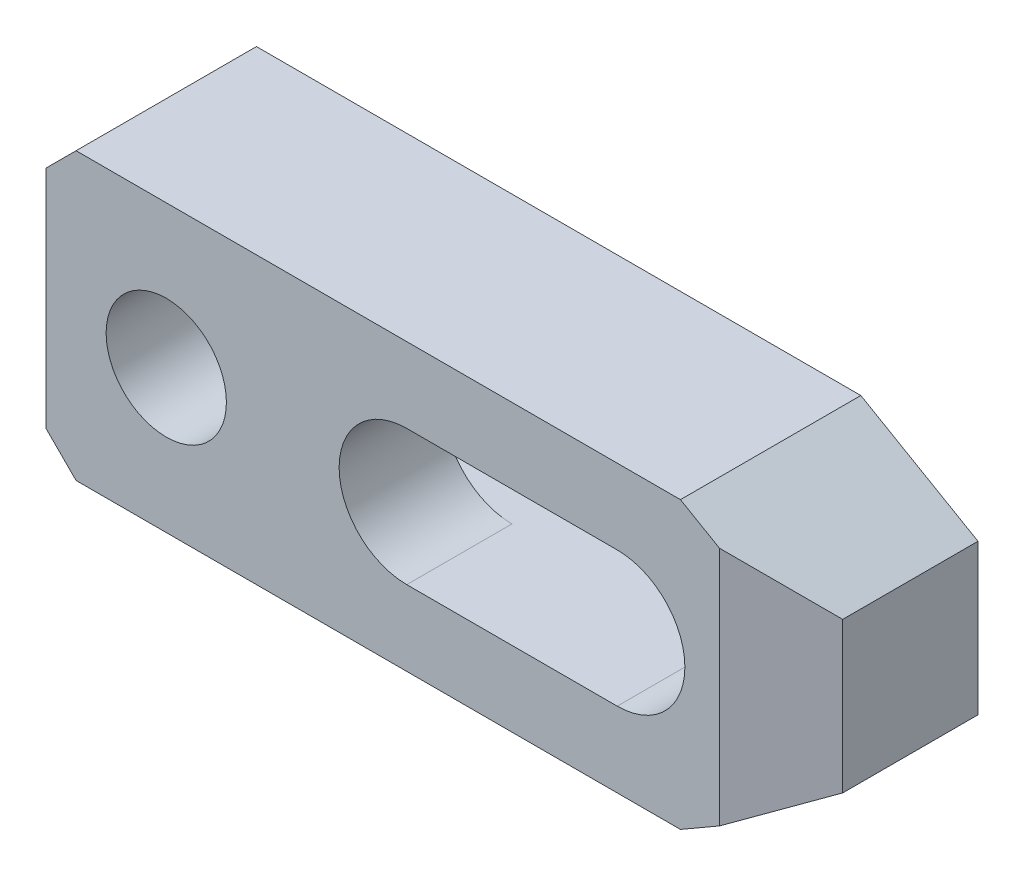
ISO-10303-21;
HEADER;
FILE_DESCRIPTION(('STEP AP214'),'2;1');
FILE_NAME('part.step','',(''),(''),'','','');
FILE_SCHEMA(('AUTOMOTIVE_DESIGN { 1 0 10303 214 1 1 1 1 }'));
ENDSEC;
DATA;
#1=APPLICATION_CONTEXT('core data for automotive mechanical design processes');
#2=APPLICATION_PROTOCOL_DEFINITION('international standard','automotive_design',2000,#1);
#3=PRODUCT_CONTEXT('',#1,'mechanical');
#4=PRODUCT('Part','Part','',(#3));
#5=PRODUCT_RELATED_PRODUCT_CATEGORY('part','',(#4));
#6=PRODUCT_DEFINITION_FORMATION('','',#4);
#7=PRODUCT_DEFINITION_CONTEXT('part definition',#1,'design');
#8=PRODUCT_DEFINITION('design','',#6,#7);
#9=PRODUCT_DEFINITION_SHAPE('','',#8);
#10=(LENGTH_UNIT() NAMED_UNIT(*) SI_UNIT(.MILLI.,.METRE.));
#11=(NAMED_UNIT(*) PLANE_ANGLE_UNIT() SI_UNIT($,.RADIAN.));
#12=(NAMED_UNIT(*) SI_UNIT($,.STERADIAN.) SOLID_ANGLE_UNIT());
#13=UNCERTAINTY_MEASURE_WITH_UNIT(LENGTH_MEASURE(1.E-05),#10,'distance_accuracy_value','');
#14=(GEOMETRIC_REPRESENTATION_CONTEXT(3) GLOBAL_UNCERTAINTY_ASSIGNED_CONTEXT((#13)) GLOBAL_UNIT_ASSIGNED_CONTEXT((#10,
#11,#12)) REPRESENTATION_CONTEXT('',''));
#15=CARTESIAN_POINT('',(0.,0.,0.));
#16=DIRECTION('',(0.,0.,1.));
#17=DIRECTION('',(1.,0.,0.));
#18=AXIS2_PLACEMENT_3D('',#15,#16,#17);
#19=CARTESIAN_POINT('',(-21.2836663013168,24.2163336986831,0.));
#20=DIRECTION('',(0.,0.,1.));
#21=DIRECTION('',(-1.,0.,0.));
#22=AXIS2_PLACEMENT_3D('',#19,#20,#21);
#23=PLANE('',#22);
#24=DIRECTION('',(0.,1.,0.));
#25=VECTOR('',#24,1.);
#26=CARTESIAN_POINT('',(-38.,-7.5,0.));
#27=LINE('',#26,#25);
#28=CARTESIAN_POINT('',(-38.,-7.5,0.));
#29=VERTEX_POINT('',#28);
#30=CARTESIAN_POINT('',(-38.,-4.5,0.));
#31=VERTEX_POINT('',#30);
#32=EDGE_CURVE('E147',#29,#31,#27,.T.);
#33=ORIENTED_EDGE('',*,*,#32,.T.);
#34=DIRECTION('',(-1.,0.,0.));
#35=VECTOR('',#34,1.);
#36=CARTESIAN_POINT('',(0.,-4.5,0.));
#37=LINE('',#36,#35);
#38=CARTESIAN_POINT('',(0.,-4.5,0.));
#39=VERTEX_POINT('',#38);
#40=EDGE_CURVE('E237',#39,#31,#37,.T.);
#41=ORIENTED_EDGE('',*,*,#40,.F.);
#42=CARTESIAN_POINT('',(0.,0.,0.));
#43=DIRECTION('',(0.,0.,1.));
#44=DIRECTION('',(-1.,0.,0.));
#45=AXIS2_PLACEMENT_3D('',#42,#43,#44);
#46=CIRCLE('',#45,4.5);
#47=CARTESIAN_POINT('',(0.,4.5,0.));
#48=VERTEX_POINT('',#47);
#49=EDGE_CURVE('E128',#39,#48,#46,.T.);
#50=ORIENTED_EDGE('',*,*,#49,.T.);
#51=DIRECTION('',(1.,0.,0.));
#52=VECTOR('',#51,1.);
#53=CARTESIAN_POINT('',(-14.,4.5,0.));
#54=LINE('',#53,#52);
#55=CARTESIAN_POINT('',(-38.,4.5,0.));
#56=VERTEX_POINT('',#55);
#57=EDGE_CURVE('E119',#56,#48,#54,.T.);
#58=ORIENTED_EDGE('',*,*,#57,.F.);
#59=CARTESIAN_POINT('',(-38.,7.5,0.));
#60=VERTEX_POINT('',#59);
#61=EDGE_CURVE('E124',#56,#60,#27,.T.);
#62=ORIENTED_EDGE('',*,*,#61,.T.);
#63=DIRECTION('',(-0.707106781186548,-0.707106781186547,0.));
#64=VECTOR('',#63,1.);
#65=CARTESIAN_POINT('',(-36.,9.5,0.));
#66=LINE('',#65,#64);
#67=CARTESIAN_POINT('',(-36.,9.5,0.));
#68=VERTEX_POINT('',#67);
#69=EDGE_CURVE('E148',#68,#60,#66,.T.);
#70=ORIENTED_EDGE('',*,*,#69,.F.);
#71=DIRECTION('',(-1.,0.,0.));
#72=VECTOR('',#71,1.);
#73=CARTESIAN_POINT('',(4.20577136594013,9.5,0.));
#74=LINE('',#73,#72);
#75=CARTESIAN_POINT('',(4.20577136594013,9.5,0.));
#76=VERTEX_POINT('',#75);
#77=EDGE_CURVE('E151',#76,#68,#74,.T.);
#78=ORIENTED_EDGE('',*,*,#77,.F.);
#79=DIRECTION('',(-0.866025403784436,0.5,0.));
#80=VECTOR('',#79,1.);
#81=CARTESIAN_POINT('',(12.,5.,0.));
#82=LINE('',#81,#80);
#83=CARTESIAN_POINT('',(12.,5.,0.));
#84=VERTEX_POINT('',#83);
#85=EDGE_CURVE('E158',#84,#76,#82,.T.);
#86=ORIENTED_EDGE('',*,*,#85,.F.);
#87=DIRECTION('',(0.,-1.,0.));
#88=VECTOR('',#87,1.);
#89=CARTESIAN_POINT('',(12.,5.,0.));
#90=LINE('',#89,#88);
#91=CARTESIAN_POINT('',(12.,-5.,0.));
#92=VERTEX_POINT('',#91);
#93=EDGE_CURVE('E181',#84,#92,#90,.T.);
#94=ORIENTED_EDGE('',*,*,#93,.T.);
#95=DIRECTION('',(-0.86602540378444,-0.5,0.));
#96=VECTOR('',#95,1.);
#97=CARTESIAN_POINT('',(12.,-5.,0.));
#98=LINE('',#97,#96);
#99=CARTESIAN_POINT('',(4.20577136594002,-9.5,0.));
#100=VERTEX_POINT('',#99);
#101=EDGE_CURVE('E208',#92,#100,#98,.T.);
#102=ORIENTED_EDGE('',*,*,#101,.T.);
#103=DIRECTION('',(-1.,0.,0.));
#104=VECTOR('',#103,1.);
#105=CARTESIAN_POINT('',(4.20577136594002,-9.5,0.));
#106=LINE('',#105,#104);
#107=CARTESIAN_POINT('',(-36.,-9.5,0.));
#108=VERTEX_POINT('',#107);
#109=EDGE_CURVE('E210',#100,#108,#106,.T.);
#110=ORIENTED_EDGE('',*,*,#109,.T.);
#111=DIRECTION('',(-0.707106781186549,0.707106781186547,0.));
#112=VECTOR('',#111,1.);
#113=CARTESIAN_POINT('',(-36.,-9.5,0.));
#114=LINE('',#113,#112);
#115=EDGE_CURVE('E150',#108,#29,#114,.T.);
#116=ORIENTED_EDGE('',*,*,#115,.T.);
#117=EDGE_LOOP('',(#33,#41,#50,#58,#62,#70,#78,#86,#94,#102,#110,#116));
#118=FACE_BOUND('',#117,.T.);
#119=ADVANCED_FACE('F14',(#118),#23,.F.);
#120=CARTESIAN_POINT('',(-38.,-7.5,12.));
#121=DIRECTION('',(-1.,0.,0.));
#122=DIRECTION('',(0.,0.,-1.));
#123=AXIS2_PLACEMENT_3D('',#120,#121,#122);
#124=PLANE('',#123);
#125=DIRECTION('',(0.,-1.,0.));
#126=VECTOR('',#125,1.);
#127=CARTESIAN_POINT('',(-38.,-7.5,5.));
#128=LINE('',#127,#126);
#129=CARTESIAN_POINT('',(-38.,4.5,5.));
#130=VERTEX_POINT('',#129);
#131=CARTESIAN_POINT('',(-38.,-4.5,5.));
#132=VERTEX_POINT('',#131);
#133=EDGE_CURVE('E141',#130,#132,#128,.T.);
#134=ORIENTED_EDGE('',*,*,#133,.T.);
#135=DIRECTION('',(0.,0.,-1.));
#136=VECTOR('',#135,1.);
#137=CARTESIAN_POINT('',(-38.,-4.5,12.));
#138=LINE('',#137,#136);
#139=EDGE_CURVE('E140',#132,#31,#138,.T.);
#140=ORIENTED_EDGE('',*,*,#139,.T.);
#141=ORIENTED_EDGE('',*,*,#32,.F.);
#142=DIRECTION('',(0.,0.,-1.));
#143=VECTOR('',#142,1.);
#144=CARTESIAN_POINT('',(-38.,-7.5,12.));
#145=LINE('',#144,#143);
#146=CARTESIAN_POINT('',(-38.,-7.5,12.));
#147=VERTEX_POINT('',#146);
#148=EDGE_CURVE('E189',#147,#29,#145,.T.);
#149=ORIENTED_EDGE('',*,*,#148,.F.);
#150=DIRECTION('',(0.,1.,0.));
#151=VECTOR('',#150,1.);
#152=CARTESIAN_POINT('',(-38.,-7.5,12.));
#153=LINE('',#152,#151);
#154=CARTESIAN_POINT('',(-38.,7.5,12.));
#155=VERTEX_POINT('',#154);
#156=EDGE_CURVE('E171',#147,#155,#153,.T.);
#157=ORIENTED_EDGE('',*,*,#156,.T.);
#158=DIRECTION('',(0.,0.,-1.));
#159=VECTOR('',#158,1.);
#160=CARTESIAN_POINT('',(-38.,7.5,12.));
#161=LINE('',#160,#159);
#162=EDGE_CURVE('E145',#155,#60,#161,.T.);
#163=ORIENTED_EDGE('',*,*,#162,.T.);
#164=ORIENTED_EDGE('',*,*,#61,.F.);
#165=DIRECTION('',(0.,0.,-1.));
#166=VECTOR('',#165,1.);
#167=CARTESIAN_POINT('',(-38.,4.5,12.));
#168=LINE('',#167,#166);
#169=EDGE_CURVE('E135',#130,#56,#168,.T.);
#170=ORIENTED_EDGE('',*,*,#169,.F.);
#171=EDGE_LOOP('',(#134,#140,#141,#149,#157,#163,#164,#170));
#172=FACE_BOUND('',#171,.T.);
#173=ADVANCED_FACE('F143',(#172),#124,.T.);
#174=CARTESIAN_POINT('',(-30.,0.,12.));
#175=DIRECTION('',(0.,0.,-1.));
#176=DIRECTION('',(1.,0.,0.));
#177=AXIS2_PLACEMENT_3D('',#174,#175,#176);
#178=CYLINDRICAL_SURFACE('',#177,4.);
#179=CARTESIAN_POINT('',(-30.,0.,12.));
#180=DIRECTION('',(0.,0.,1.));
#181=DIRECTION('',(-1.,0.,0.));
#182=AXIS2_PLACEMENT_3D('',#179,#180,#181);
#183=CIRCLE('',#182,4.);
#184=CARTESIAN_POINT('',(-34.,0.,12.));
#185=VERTEX_POINT('',#184);
#186=EDGE_CURVE('E161',#185,#185,#183,.T.);
#187=ORIENTED_EDGE('',*,*,#186,.T.);
#188=EDGE_LOOP('',(#187));
#189=FACE_BOUND('',#188,.T.);
#190=CARTESIAN_POINT('',(-30.,0.,5.));
#191=DIRECTION('',(0.,0.,-1.));
#192=DIRECTION('',(1.,0.,0.));
#193=AXIS2_PLACEMENT_3D('',#190,#191,#192);
#194=CIRCLE('',#193,4.);
#195=CARTESIAN_POINT('',(-26.,0.,5.));
#196=VERTEX_POINT('',#195);
#197=EDGE_CURVE('E425',#196,#196,#194,.T.);
#198=ORIENTED_EDGE('',*,*,#197,.T.);
#199=EDGE_LOOP('',(#198));
#200=FACE_BOUND('',#199,.T.);
#201=ADVANCED_FACE('F262',(#189,#200),#178,.F.);
#202=CARTESIAN_POINT('',(-14.,0.,12.));
#203=DIRECTION('',(0.,0.,-1.));
#204=DIRECTION('',(1.,0.,0.));
#205=AXIS2_PLACEMENT_3D('',#202,#203,#204);
#206=CYLINDRICAL_SURFACE('',#205,4.5);
#207=DIRECTION('',(0.,0.,-1.));
#208=VECTOR('',#207,1.);
#209=CARTESIAN_POINT('',(-14.,-4.5,12.));
#210=LINE('',#209,#208);
#211=CARTESIAN_POINT('',(-14.,-4.5,12.));
#212=VERTEX_POINT('',#211);
#213=CARTESIAN_POINT('',(-14.,-4.5,5.));
#214=VERTEX_POINT('',#213);
#215=EDGE_CURVE('E256',#212,#214,#210,.T.);
#216=ORIENTED_EDGE('',*,*,#215,.T.);
#217=CARTESIAN_POINT('',(-14.,0.,5.));
#218=DIRECTION('',(0.,0.,-1.));
#219=DIRECTION('',(1.,0.,0.));
#220=AXIS2_PLACEMENT_3D('',#217,#218,#219);
#221=CIRCLE('',#220,4.5);
#222=CARTESIAN_POINT('',(-14.,4.5,5.));
#223=VERTEX_POINT('',#222);
#224=EDGE_CURVE('E278',#214,#223,#221,.T.);
#225=ORIENTED_EDGE('',*,*,#224,.T.);
#226=DIRECTION('',(0.,0.,-1.));
#227=VECTOR('',#226,1.);
#228=CARTESIAN_POINT('',(-14.,4.5,12.));
#229=LINE('',#228,#227);
#230=CARTESIAN_POINT('',(-14.,4.5,12.));
#231=VERTEX_POINT('',#230);
#232=EDGE_CURVE('E244',#231,#223,#229,.T.);
#233=ORIENTED_EDGE('',*,*,#232,.F.);
#234=CARTESIAN_POINT('',(-14.,0.,12.));
#235=DIRECTION('',(0.,0.,1.));
#236=DIRECTION('',(-1.,0.,0.));
#237=AXIS2_PLACEMENT_3D('',#234,#235,#236);
#238=CIRCLE('',#237,4.5);
#239=EDGE_CURVE('E132',#231,#212,#238,.T.);
#240=ORIENTED_EDGE('',*,*,#239,.T.);
#241=EDGE_LOOP('',(#216,#225,#233,#240));
#242=FACE_BOUND('',#241,.T.);
#243=ADVANCED_FACE('F269',(#242),#206,.F.);
#244=CARTESIAN_POINT('',(-21.2836663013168,24.2163336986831,12.));
#245=DIRECTION('',(0.,0.,1.));
#246=DIRECTION('',(-1.,0.,0.));
#247=AXIS2_PLACEMENT_3D('',#244,#245,#246);
#248=PLANE('',#247);
#249=DIRECTION('',(0.,-1.,0.));
#250=VECTOR('',#249,1.);
#251=CARTESIAN_POINT('',(6.80384757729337,24.2163336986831,12.));
#252=LINE('',#251,#250);
#253=CARTESIAN_POINT('',(6.80384757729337,8.,12.));
#254=VERTEX_POINT('',#253);
#255=CARTESIAN_POINT('',(6.80384757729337,-8.,12.));
#256=VERTEX_POINT('',#255);
#257=EDGE_CURVE('E233',#254,#256,#252,.T.);
#258=ORIENTED_EDGE('',*,*,#257,.F.);
#259=DIRECTION('',(-0.866025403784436,0.5,0.));
#260=VECTOR('',#259,1.);
#261=CARTESIAN_POINT('',(12.,5.,12.));
#262=LINE('',#261,#260);
#263=CARTESIAN_POINT('',(4.20577136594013,9.5,12.));
#264=VERTEX_POINT('',#263);
#265=EDGE_CURVE('E179',#254,#264,#262,.T.);
#266=ORIENTED_EDGE('',*,*,#265,.T.);
#267=DIRECTION('',(-1.,0.,0.));
#268=VECTOR('',#267,1.);
#269=CARTESIAN_POINT('',(4.20577136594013,9.5,12.));
#270=LINE('',#269,#268);
#271=CARTESIAN_POINT('',(-36.,9.5,12.));
#272=VERTEX_POINT('',#271);
#273=EDGE_CURVE('E176',#264,#272,#270,.T.);
#274=ORIENTED_EDGE('',*,*,#273,.T.);
#275=DIRECTION('',(-0.707106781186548,-0.707106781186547,0.));
#276=VECTOR('',#275,1.);
#277=CARTESIAN_POINT('',(-36.,9.5,12.));
#278=LINE('',#277,#276);
#279=EDGE_CURVE('E173',#272,#155,#278,.T.);
#280=ORIENTED_EDGE('',*,*,#279,.T.);
#281=ORIENTED_EDGE('',*,*,#156,.F.);
#282=DIRECTION('',(-0.707106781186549,0.707106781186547,0.));
#283=VECTOR('',#282,1.);
#284=CARTESIAN_POINT('',(-36.,-9.5,12.));
#285=LINE('',#284,#283);
#286=CARTESIAN_POINT('',(-36.,-9.5,12.));
#287=VERTEX_POINT('',#286);
#288=EDGE_CURVE('E168',#287,#147,#285,.T.);
#289=ORIENTED_EDGE('',*,*,#288,.F.);
#290=DIRECTION('',(-1.,0.,0.));
#291=VECTOR('',#290,1.);
#292=CARTESIAN_POINT('',(4.20577136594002,-9.5,12.));
#293=LINE('',#292,#291);
#294=CARTESIAN_POINT('',(4.20577136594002,-9.5,12.));
#295=VERTEX_POINT('',#294);
#296=EDGE_CURVE('E165',#295,#287,#293,.T.);
#297=ORIENTED_EDGE('',*,*,#296,.F.);
#298=DIRECTION('',(-0.86602540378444,-0.5,0.));
#299=VECTOR('',#298,1.);
#300=CARTESIAN_POINT('',(12.,-5.,12.));
#301=LINE('',#300,#299);
#302=EDGE_CURVE('E162',#256,#295,#301,.T.);
#303=ORIENTED_EDGE('',*,*,#302,.F.);
#304=EDGE_LOOP('',(#258,#266,#274,#280,#281,#289,#297,#303));
#305=FACE_BOUND('',#304,.T.);
#306=ORIENTED_EDGE('',*,*,#186,.F.);
#307=EDGE_LOOP('',(#306));
#308=FACE_BOUND('',#307,.T.);
#309=DIRECTION('',(-1.,0.,0.));
#310=VECTOR('',#309,1.);
#311=CARTESIAN_POINT('',(0.,-4.5,12.));
#312=LINE('',#311,#310);
#313=CARTESIAN_POINT('',(0.,-4.5,12.));
#314=VERTEX_POINT('',#313);
#315=EDGE_CURVE('E247',#314,#212,#312,.T.);
#316=ORIENTED_EDGE('',*,*,#315,.T.);
#317=ORIENTED_EDGE('',*,*,#239,.F.);
#318=DIRECTION('',(1.,0.,0.));
#319=VECTOR('',#318,1.);
#320=CARTESIAN_POINT('',(-14.,4.5,12.));
#321=LINE('',#320,#319);
#322=CARTESIAN_POINT('',(0.,4.5,12.));
#323=VERTEX_POINT('',#322);
#324=EDGE_CURVE('E241',#231,#323,#321,.T.);
#325=ORIENTED_EDGE('',*,*,#324,.T.);
#326=CARTESIAN_POINT('',(0.,0.,12.));
#327=DIRECTION('',(0.,0.,1.));
#328=DIRECTION('',(-1.,0.,0.));
#329=AXIS2_PLACEMENT_3D('',#326,#327,#328);
#330=CIRCLE('',#329,4.5);
#331=EDGE_CURVE('E245',#314,#323,#330,.T.);
#332=ORIENTED_EDGE('',*,*,#331,.F.);
#333=EDGE_LOOP('',(#316,#317,#325,#332));
#334=FACE_BOUND('',#333,.T.);
#335=ADVANCED_FACE('F265',(#305,#308,#334),#248,.T.);
#336=CARTESIAN_POINT('',(12.,5.,12.));
#337=DIRECTION('',(-0.5,-0.866025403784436,0.));
#338=DIRECTION('',(0.866025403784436,-0.5,0.));
#339=AXIS2_PLACEMENT_3D('',#336,#337,#338);
#340=PLANE('',#339);
#341=ORIENTED_EDGE('',*,*,#265,.F.);
#342=DIRECTION('',(0.774596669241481,-0.447213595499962,-0.447213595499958));
#343=VECTOR('',#342,1.);
#344=CARTESIAN_POINT('',(10.9607695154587,5.6,9.6));
#345=LINE('',#344,#343);
#346=CARTESIAN_POINT('',(12.,5.,9.));
#347=VERTEX_POINT('',#346);
#348=EDGE_CURVE('E235',#254,#347,#345,.T.);
#349=ORIENTED_EDGE('',*,*,#348,.T.);
#350=DIRECTION('',(0.,0.,-1.));
#351=VECTOR('',#350,1.);
#352=CARTESIAN_POINT('',(12.,5.,12.));
#353=LINE('',#352,#351);
#354=EDGE_CURVE('E164',#347,#84,#353,.T.);
#355=ORIENTED_EDGE('',*,*,#354,.T.);
#356=ORIENTED_EDGE('',*,*,#85,.T.);
#357=DIRECTION('',(0.,0.,-1.));
#358=VECTOR('',#357,1.);
#359=CARTESIAN_POINT('',(4.20577136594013,9.5,12.));
#360=LINE('',#359,#358);
#361=EDGE_CURVE('E9',#264,#76,#360,.T.);
#362=ORIENTED_EDGE('',*,*,#361,.F.);
#363=EDGE_LOOP('',(#341,#349,#355,#356,#362));
#364=FACE_BOUND('',#363,.T.);
#365=ADVANCED_FACE('F268',(#364),#340,.F.);
#366=CARTESIAN_POINT('',(4.20577136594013,9.5,12.));
#367=DIRECTION('',(0.,-1.,0.));
#368=DIRECTION('',(1.,0.,0.));
#369=AXIS2_PLACEMENT_3D('',#366,#367,#368);
#370=PLANE('',#369);
#371=DIRECTION('',(0.,0.,-1.));
#372=VECTOR('',#371,1.);
#373=CARTESIAN_POINT('',(-36.,9.5,12.));
#374=LINE('',#373,#372);
#375=EDGE_CURVE('E22',#272,#68,#374,.T.);
#376=ORIENTED_EDGE('',*,*,#375,.F.);
#377=ORIENTED_EDGE('',*,*,#273,.F.);
#378=ORIENTED_EDGE('',*,*,#361,.T.);
#379=ORIENTED_EDGE('',*,*,#77,.T.);
#380=EDGE_LOOP('',(#376,#377,#378,#379));
#381=FACE_BOUND('',#380,.T.);
#382=ADVANCED_FACE('F16',(#381),#370,.F.);
#383=CARTESIAN_POINT('',(-36.,9.5,12.));
#384=DIRECTION('',(0.707106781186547,-0.707106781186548,0.));
#385=DIRECTION('',(0.707106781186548,0.707106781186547,0.));
#386=AXIS2_PLACEMENT_3D('',#383,#384,#385);
#387=PLANE('',#386);
#388=ORIENTED_EDGE('',*,*,#162,.F.);
#389=ORIENTED_EDGE('',*,*,#279,.F.);
#390=ORIENTED_EDGE('',*,*,#375,.T.);
#391=ORIENTED_EDGE('',*,*,#69,.T.);
#392=EDGE_LOOP('',(#388,#389,#390,#391));
#393=FACE_BOUND('',#392,.T.);
#394=ADVANCED_FACE('F193',(#393),#387,.F.);
#395=CARTESIAN_POINT('',(-36.,-9.5,12.));
#396=DIRECTION('',(-0.707106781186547,-0.707106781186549,0.));
#397=DIRECTION('',(0.707106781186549,-0.707106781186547,0.));
#398=AXIS2_PLACEMENT_3D('',#395,#396,#397);
#399=PLANE('',#398);
#400=DIRECTION('',(0.,0.,-1.));
#401=VECTOR('',#400,1.);
#402=CARTESIAN_POINT('',(-36.,-9.5,12.));
#403=LINE('',#402,#401);
#404=EDGE_CURVE('E187',#287,#108,#403,.T.);
#405=ORIENTED_EDGE('',*,*,#404,.F.);
#406=ORIENTED_EDGE('',*,*,#288,.T.);
#407=ORIENTED_EDGE('',*,*,#148,.T.);
#408=ORIENTED_EDGE('',*,*,#115,.F.);
#409=EDGE_LOOP('',(#405,#406,#407,#408));
#410=FACE_BOUND('',#409,.T.);
#411=ADVANCED_FACE('F220',(#410),#399,.T.);
#412=CARTESIAN_POINT('',(4.20577136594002,-9.5,12.));
#413=DIRECTION('',(0.,-1.,0.));
#414=DIRECTION('',(1.,0.,0.));
#415=AXIS2_PLACEMENT_3D('',#412,#413,#414);
#416=PLANE('',#415);
#417=DIRECTION('',(0.,0.,-1.));
#418=VECTOR('',#417,1.);
#419=CARTESIAN_POINT('',(4.20577136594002,-9.5,12.));
#420=LINE('',#419,#418);
#421=EDGE_CURVE('E185',#295,#100,#420,.T.);
#422=ORIENTED_EDGE('',*,*,#421,.F.);
#423=ORIENTED_EDGE('',*,*,#296,.T.);
#424=ORIENTED_EDGE('',*,*,#404,.T.);
#425=ORIENTED_EDGE('',*,*,#109,.F.);
#426=EDGE_LOOP('',(#422,#423,#424,#425));
#427=FACE_BOUND('',#426,.T.);
#428=ADVANCED_FACE('F306',(#427),#416,.T.);
#429=CARTESIAN_POINT('',(12.,-5.,12.));
#430=DIRECTION('',(0.5,-0.86602540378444,0.));
#431=DIRECTION('',(0.86602540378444,0.5,0.));
#432=AXIS2_PLACEMENT_3D('',#429,#430,#431);
#433=PLANE('',#432);
#434=DIRECTION('',(0.774596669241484,0.447213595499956,-0.44721359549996));
#435=VECTOR('',#434,1.);
#436=CARTESIAN_POINT('',(10.9607695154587,-5.6,9.6));
#437=LINE('',#436,#435);
#438=CARTESIAN_POINT('',(12.,-5.,9.));
#439=VERTEX_POINT('',#438);
#440=EDGE_CURVE('E37',#256,#439,#437,.T.);
#441=ORIENTED_EDGE('',*,*,#440,.F.);
#442=ORIENTED_EDGE('',*,*,#302,.T.);
#443=ORIENTED_EDGE('',*,*,#421,.T.);
#444=ORIENTED_EDGE('',*,*,#101,.F.);
#445=DIRECTION('',(0.,0.,-1.));
#446=VECTOR('',#445,1.);
#447=CARTESIAN_POINT('',(12.,-5.,12.));
#448=LINE('',#447,#446);
#449=EDGE_CURVE('E183',#439,#92,#448,.T.);
#450=ORIENTED_EDGE('',*,*,#449,.F.);
#451=EDGE_LOOP('',(#441,#442,#443,#444,#450));
#452=FACE_BOUND('',#451,.T.);
#453=ADVANCED_FACE('F303',(#452),#433,.T.);
#454=CARTESIAN_POINT('',(12.,5.,12.));
#455=DIRECTION('',(1.,0.,0.));
#456=DIRECTION('',(0.,0.,1.));
#457=AXIS2_PLACEMENT_3D('',#454,#455,#456);
#458=PLANE('',#457);
#459=DIRECTION('',(0.,-1.,0.));
#460=VECTOR('',#459,1.);
#461=CARTESIAN_POINT('',(12.,20.,9.));
#462=LINE('',#461,#460);
#463=EDGE_CURVE('E227',#347,#439,#462,.T.);
#464=ORIENTED_EDGE('',*,*,#463,.T.);
#465=ORIENTED_EDGE('',*,*,#449,.T.);
#466=ORIENTED_EDGE('',*,*,#93,.F.);
#467=ORIENTED_EDGE('',*,*,#354,.F.);
#468=EDGE_LOOP('',(#464,#465,#466,#467));
#469=FACE_BOUND('',#468,.T.);
#470=ADVANCED_FACE('F205',(#469),#458,.T.);
#471=CARTESIAN_POINT('',(0.,-4.5,12.));
#472=DIRECTION('',(0.,-1.,0.));
#473=DIRECTION('',(1.,0.,0.));
#474=AXIS2_PLACEMENT_3D('',#471,#472,#473);
#475=PLANE('',#474);
#476=ORIENTED_EDGE('',*,*,#40,.T.);
#477=ORIENTED_EDGE('',*,*,#139,.F.);
#478=DIRECTION('',(1.,0.,0.));
#479=VECTOR('',#478,1.);
#480=CARTESIAN_POINT('',(-58.,-4.5,5.));
#481=LINE('',#480,#479);
#482=EDGE_CURVE('E276',#132,#214,#481,.T.);
#483=ORIENTED_EDGE('',*,*,#482,.T.);
#484=ORIENTED_EDGE('',*,*,#215,.F.);
#485=ORIENTED_EDGE('',*,*,#315,.F.);
#486=DIRECTION('',(0.,0.,-1.));
#487=VECTOR('',#486,1.);
#488=CARTESIAN_POINT('',(0.,-4.5,12.));
#489=LINE('',#488,#487);
#490=EDGE_CURVE('E255',#314,#39,#489,.T.);
#491=ORIENTED_EDGE('',*,*,#490,.T.);
#492=EDGE_LOOP('',(#476,#477,#483,#484,#485,#491));
#493=FACE_BOUND('',#492,.T.);
#494=ADVANCED_FACE('F275',(#493),#475,.F.);
#495=CARTESIAN_POINT('',(0.,0.,12.));
#496=DIRECTION('',(0.,0.,-1.));
#497=DIRECTION('',(1.,0.,0.));
#498=AXIS2_PLACEMENT_3D('',#495,#496,#497);
#499=CYLINDRICAL_SURFACE('',#498,4.5);
#500=DIRECTION('',(0.,0.,-1.));
#501=VECTOR('',#500,1.);
#502=CARTESIAN_POINT('',(0.,4.5,12.));
#503=LINE('',#502,#501);
#504=EDGE_CURVE('E253',#323,#48,#503,.T.);
#505=ORIENTED_EDGE('',*,*,#504,.T.);
#506=ORIENTED_EDGE('',*,*,#49,.F.);
#507=ORIENTED_EDGE('',*,*,#490,.F.);
#508=ORIENTED_EDGE('',*,*,#331,.T.);
#509=EDGE_LOOP('',(#505,#506,#507,#508));
#510=FACE_BOUND('',#509,.T.);
#511=ADVANCED_FACE('F280',(#510),#499,.F.);
#512=CARTESIAN_POINT('',(-14.,4.5,12.));
#513=DIRECTION('',(0.,1.,0.));
#514=DIRECTION('',(-1.,0.,0.));
#515=AXIS2_PLACEMENT_3D('',#512,#513,#514);
#516=PLANE('',#515);
#517=ORIENTED_EDGE('',*,*,#57,.T.);
#518=ORIENTED_EDGE('',*,*,#504,.F.);
#519=ORIENTED_EDGE('',*,*,#324,.F.);
#520=ORIENTED_EDGE('',*,*,#232,.T.);
#521=DIRECTION('',(1.,0.,0.));
#522=VECTOR('',#521,1.);
#523=CARTESIAN_POINT('',(-58.,4.5,5.));
#524=LINE('',#523,#522);
#525=EDGE_CURVE('E29',#130,#223,#524,.T.);
#526=ORIENTED_EDGE('',*,*,#525,.F.);
#527=ORIENTED_EDGE('',*,*,#169,.T.);
#528=EDGE_LOOP('',(#517,#518,#519,#520,#526,#527));
#529=FACE_BOUND('',#528,.T.);
#530=ADVANCED_FACE('F136',(#529),#516,.F.);
#531=CARTESIAN_POINT('',(-0.124355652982,20.,16.));
#532=DIRECTION('',(-0.5,0.,-0.866025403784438));
#533=DIRECTION('',(0.866025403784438,0.,-0.5));
#534=AXIS2_PLACEMENT_3D('',#531,#532,#533);
#535=PLANE('',#534);
#536=ORIENTED_EDGE('',*,*,#257,.T.);
#537=ORIENTED_EDGE('',*,*,#440,.T.);
#538=ORIENTED_EDGE('',*,*,#463,.F.);
#539=ORIENTED_EDGE('',*,*,#348,.F.);
#540=EDGE_LOOP('',(#536,#537,#538,#539));
#541=FACE_BOUND('',#540,.T.);
#542=ADVANCED_FACE('F288',(#541),#535,.F.);
#543=CARTESIAN_POINT('',(-58.,-4.5,5.));
#544=DIRECTION('',(0.,0.,-1.));
#545=DIRECTION('',(1.,0.,0.));
#546=AXIS2_PLACEMENT_3D('',#543,#544,#545);
#547=PLANE('',#546);
#548=ORIENTED_EDGE('',*,*,#197,.F.);
#549=EDGE_LOOP('',(#548));
#550=FACE_BOUND('',#549,.T.);
#551=ORIENTED_EDGE('',*,*,#525,.T.);
#552=ORIENTED_EDGE('',*,*,#224,.F.);
#553=ORIENTED_EDGE('',*,*,#482,.F.);
#554=ORIENTED_EDGE('',*,*,#133,.F.);
#555=EDGE_LOOP('',(#551,#552,#553,#554));
#556=FACE_BOUND('',#555,.T.);
#557=ADVANCED_FACE('F410',(#550,#556),#547,.T.);
#558=CLOSED_SHELL('',(#119,#173,#201,#243,#335,#365,#382,#394,#411,#428,#453,#470,#494,#511,
#530,#542,#557));
#559=MANIFOLD_SOLID_BREP('B1',#558);
#560=ADVANCED_BREP_SHAPE_REPRESENTATION('',(#18,#559),#14);
#561=SHAPE_DEFINITION_REPRESENTATION(#9,#560);
ENDSEC;
END-ISO-10303-21;
